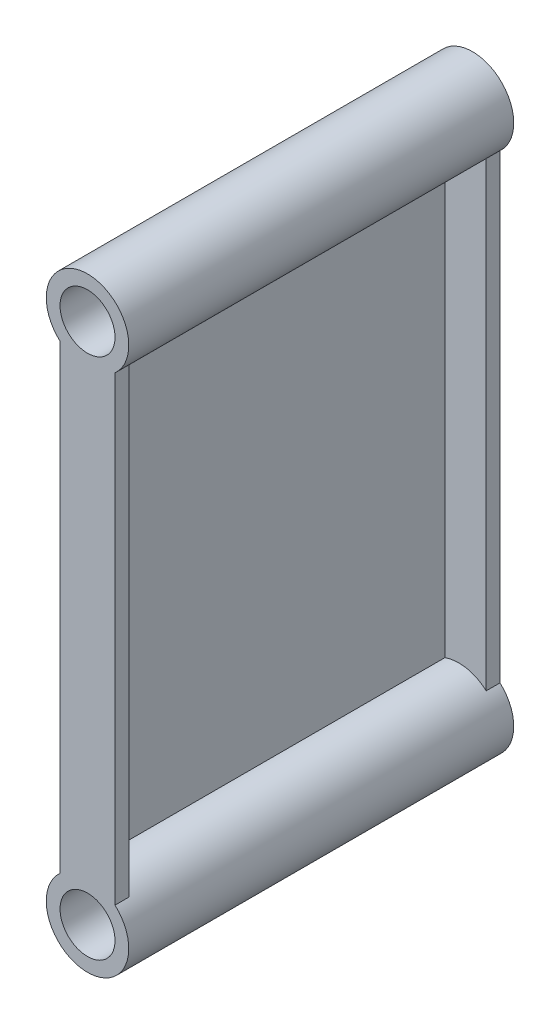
ISO-10303-21;
HEADER;
FILE_DESCRIPTION(('STEP AP214'),'2;1');
FILE_NAME('part.step','',(''),(''),'','','');
FILE_SCHEMA(('AUTOMOTIVE_DESIGN { 1 0 10303 214 1 1 1 1 }'));
ENDSEC;
DATA;
#1=APPLICATION_CONTEXT('core data for automotive mechanical design processes');
#2=APPLICATION_PROTOCOL_DEFINITION('international standard','automotive_design',2000,#1);
#3=PRODUCT_CONTEXT('',#1,'mechanical');
#4=PRODUCT('Part','Part','',(#3));
#5=PRODUCT_RELATED_PRODUCT_CATEGORY('part','',(#4));
#6=PRODUCT_DEFINITION_FORMATION('','',#4);
#7=PRODUCT_DEFINITION_CONTEXT('part definition',#1,'design');
#8=PRODUCT_DEFINITION('design','',#6,#7);
#9=PRODUCT_DEFINITION_SHAPE('','',#8);
#10=(LENGTH_UNIT() NAMED_UNIT(*) SI_UNIT(.MILLI.,.METRE.));
#11=(NAMED_UNIT(*) PLANE_ANGLE_UNIT() SI_UNIT($,.RADIAN.));
#12=(NAMED_UNIT(*) SI_UNIT($,.STERADIAN.) SOLID_ANGLE_UNIT());
#13=UNCERTAINTY_MEASURE_WITH_UNIT(LENGTH_MEASURE(1.E-05),#10,'distance_accuracy_value','');
#14=(GEOMETRIC_REPRESENTATION_CONTEXT(3) GLOBAL_UNCERTAINTY_ASSIGNED_CONTEXT((#13)) GLOBAL_UNIT_ASSIGNED_CONTEXT((#10,
#11,#12)) REPRESENTATION_CONTEXT('',''));
#15=CARTESIAN_POINT('',(0.,0.,0.));
#16=DIRECTION('',(0.,0.,1.));
#17=DIRECTION('',(1.,0.,0.));
#18=AXIS2_PLACEMENT_3D('',#15,#16,#17);
#19=CARTESIAN_POINT('',(0.999999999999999,8.3819660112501,14.));
#20=DIRECTION('',(-1.,0.,0.));
#21=DIRECTION('',(0.,-1.,0.));
#22=AXIS2_PLACEMENT_3D('',#19,#20,#21);
#23=PLANE('',#22);
#24=DIRECTION('',(0.,1.,0.));
#25=VECTOR('',#24,1.);
#26=CARTESIAN_POINT('',(0.999999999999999,8.3819660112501,0.5));
#27=LINE('',#26,#25);
#28=CARTESIAN_POINT('',(1.,-8.38196601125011,0.5));
#29=VERTEX_POINT('',#28);
#30=CARTESIAN_POINT('',(0.999999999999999,8.3819660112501,0.5));
#31=VERTEX_POINT('',#30);
#32=EDGE_CURVE('E160',#29,#31,#27,.T.);
#33=ORIENTED_EDGE('',*,*,#32,.F.);
#34=DIRECTION('',(0.,0.,-1.));
#35=VECTOR('',#34,1.);
#36=CARTESIAN_POINT('',(1.,-8.38196601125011,14.));
#37=LINE('',#36,#35);
#38=CARTESIAN_POINT('',(1.,-8.38196601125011,0.));
#39=VERTEX_POINT('',#38);
#40=EDGE_CURVE('E126',#29,#39,#37,.T.);
#41=ORIENTED_EDGE('',*,*,#40,.T.);
#42=DIRECTION('',(0.,1.,0.));
#43=VECTOR('',#42,1.);
#44=CARTESIAN_POINT('',(0.999999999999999,8.3819660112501,0.));
#45=LINE('',#44,#43);
#46=CARTESIAN_POINT('',(0.999999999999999,8.3819660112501,0.));
#47=VERTEX_POINT('',#46);
#48=EDGE_CURVE('E132',#39,#47,#45,.T.);
#49=ORIENTED_EDGE('',*,*,#48,.T.);
#50=DIRECTION('',(0.,0.,-1.));
#51=VECTOR('',#50,1.);
#52=CARTESIAN_POINT('',(0.999999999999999,8.3819660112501,14.));
#53=LINE('',#52,#51);
#54=EDGE_CURVE('E76',#31,#47,#53,.T.);
#55=ORIENTED_EDGE('',*,*,#54,.F.);
#56=EDGE_LOOP('',(#33,#41,#49,#55));
#57=FACE_BOUND('',#56,.T.);
#58=ADVANCED_FACE('F30',(#57),#23,.F.);
#59=CARTESIAN_POINT('',(0.,9.49999999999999,14.));
#60=DIRECTION('',(0.,0.,-1.));
#61=DIRECTION('',(-1.,0.,0.));
#62=AXIS2_PLACEMENT_3D('',#59,#60,#61);
#63=CYLINDRICAL_SURFACE('',#62,1.5);
#64=CARTESIAN_POINT('',(0.,9.49999999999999,0.));
#65=DIRECTION('',(0.,0.,1.));
#66=DIRECTION('',(1.,0.,0.));
#67=AXIS2_PLACEMENT_3D('',#64,#65,#66);
#68=CIRCLE('',#67,1.5);
#69=CARTESIAN_POINT('',(-1.,8.38196601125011,0.));
#70=VERTEX_POINT('',#69);
#71=EDGE_CURVE('E139',#47,#70,#68,.T.);
#72=ORIENTED_EDGE('',*,*,#71,.T.);
#73=DIRECTION('',(0.,0.,-1.));
#74=VECTOR('',#73,1.);
#75=CARTESIAN_POINT('',(-1.,8.38196601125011,14.));
#76=LINE('',#75,#74);
#77=CARTESIAN_POINT('',(-1.,8.38196601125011,14.));
#78=VERTEX_POINT('',#77);
#79=EDGE_CURVE('E11',#78,#70,#76,.T.);
#80=ORIENTED_EDGE('',*,*,#79,.F.);
#81=CARTESIAN_POINT('',(0.,9.49999999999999,14.));
#82=DIRECTION('',(0.,0.,1.));
#83=DIRECTION('',(1.,0.,0.));
#84=AXIS2_PLACEMENT_3D('',#81,#82,#83);
#85=CIRCLE('',#84,1.5);
#86=CARTESIAN_POINT('',(0.999999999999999,8.3819660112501,14.));
#87=VERTEX_POINT('',#86);
#88=EDGE_CURVE('E134',#87,#78,#85,.T.);
#89=ORIENTED_EDGE('',*,*,#88,.F.);
#90=CARTESIAN_POINT('',(0.999999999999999,8.3819660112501,13.5));
#91=VERTEX_POINT('',#90);
#92=EDGE_CURVE('E129',#87,#91,#53,.T.);
#93=ORIENTED_EDGE('',*,*,#92,.T.);
#94=CARTESIAN_POINT('',(0.,9.49999999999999,13.5));
#95=DIRECTION('',(0.,0.,1.));
#96=DIRECTION('',(1.,0.,0.));
#97=AXIS2_PLACEMENT_3D('',#94,#95,#96);
#98=CIRCLE('',#97,1.5);
#99=CARTESIAN_POINT('',(-0.500000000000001,8.0857864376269,13.5));
#100=VERTEX_POINT('',#99);
#101=EDGE_CURVE('E45',#100,#91,#98,.T.);
#102=ORIENTED_EDGE('',*,*,#101,.F.);
#103=DIRECTION('',(0.,0.,1.));
#104=VECTOR('',#103,1.);
#105=CARTESIAN_POINT('',(-0.500000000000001,8.0857864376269,0.));
#106=LINE('',#105,#104);
#107=CARTESIAN_POINT('',(-0.500000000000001,8.0857864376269,0.5));
#108=VERTEX_POINT('',#107);
#109=EDGE_CURVE('E122',#108,#100,#106,.T.);
#110=ORIENTED_EDGE('',*,*,#109,.F.);
#111=CARTESIAN_POINT('',(0.,9.49999999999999,0.5));
#112=DIRECTION('',(0.,0.,1.));
#113=DIRECTION('',(1.,0.,0.));
#114=AXIS2_PLACEMENT_3D('',#111,#112,#113);
#115=CIRCLE('',#114,1.5);
#116=EDGE_CURVE('E164',#108,#31,#115,.T.);
#117=ORIENTED_EDGE('',*,*,#116,.T.);
#118=ORIENTED_EDGE('',*,*,#54,.T.);
#119=EDGE_LOOP('',(#72,#80,#89,#93,#102,#110,#117,#118));
#120=FACE_BOUND('',#119,.T.);
#121=ADVANCED_FACE('F32',(#120),#63,.T.);
#122=CARTESIAN_POINT('',(-1.,8.38196601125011,14.));
#123=DIRECTION('',(1.,0.,0.));
#124=DIRECTION('',(0.,1.,0.));
#125=AXIS2_PLACEMENT_3D('',#122,#123,#124);
#126=PLANE('',#125);
#127=DIRECTION('',(0.,-1.,0.));
#128=VECTOR('',#127,1.);
#129=CARTESIAN_POINT('',(-1.,8.38196601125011,0.));
#130=LINE('',#129,#128);
#131=CARTESIAN_POINT('',(-0.999999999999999,-8.38196601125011,0.));
#132=VERTEX_POINT('',#131);
#133=EDGE_CURVE('E137',#70,#132,#130,.T.);
#134=ORIENTED_EDGE('',*,*,#133,.T.);
#135=DIRECTION('',(0.,0.,-1.));
#136=VECTOR('',#135,1.);
#137=CARTESIAN_POINT('',(-0.999999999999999,-8.38196601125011,14.));
#138=LINE('',#137,#136);
#139=CARTESIAN_POINT('',(-0.999999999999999,-8.38196601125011,14.));
#140=VERTEX_POINT('',#139);
#141=EDGE_CURVE('E38',#140,#132,#138,.T.);
#142=ORIENTED_EDGE('',*,*,#141,.F.);
#143=DIRECTION('',(0.,-1.,0.));
#144=VECTOR('',#143,1.);
#145=CARTESIAN_POINT('',(-1.,8.38196601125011,14.));
#146=LINE('',#145,#144);
#147=EDGE_CURVE('E83',#78,#140,#146,.T.);
#148=ORIENTED_EDGE('',*,*,#147,.F.);
#149=ORIENTED_EDGE('',*,*,#79,.T.);
#150=EDGE_LOOP('',(#134,#142,#148,#149));
#151=FACE_BOUND('',#150,.T.);
#152=ADVANCED_FACE('F184',(#151),#126,.F.);
#153=CARTESIAN_POINT('',(0.,-9.5,14.));
#154=DIRECTION('',(0.,0.,-1.));
#155=DIRECTION('',(-1.,0.,0.));
#156=AXIS2_PLACEMENT_3D('',#153,#154,#155);
#157=CYLINDRICAL_SURFACE('',#156,1.5);
#158=CARTESIAN_POINT('',(0.,-9.5,0.));
#159=DIRECTION('',(0.,0.,1.));
#160=DIRECTION('',(1.,0.,0.));
#161=AXIS2_PLACEMENT_3D('',#158,#159,#160);
#162=CIRCLE('',#161,1.5);
#163=EDGE_CURVE('E135',#132,#39,#162,.T.);
#164=ORIENTED_EDGE('',*,*,#163,.T.);
#165=ORIENTED_EDGE('',*,*,#40,.F.);
#166=CARTESIAN_POINT('',(0.,-9.5,0.5));
#167=DIRECTION('',(0.,0.,1.));
#168=DIRECTION('',(1.,0.,0.));
#169=AXIS2_PLACEMENT_3D('',#166,#167,#168);
#170=CIRCLE('',#169,1.5);
#171=CARTESIAN_POINT('',(-0.499999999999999,-8.08578643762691,0.5));
#172=VERTEX_POINT('',#171);
#173=EDGE_CURVE('E116',#29,#172,#170,.T.);
#174=ORIENTED_EDGE('',*,*,#173,.T.);
#175=DIRECTION('',(0.,0.,1.));
#176=VECTOR('',#175,1.);
#177=CARTESIAN_POINT('',(-0.499999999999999,-8.08578643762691,0.));
#178=LINE('',#177,#176);
#179=CARTESIAN_POINT('',(-0.499999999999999,-8.08578643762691,13.5));
#180=VERTEX_POINT('',#179);
#181=EDGE_CURVE('E114',#172,#180,#178,.T.);
#182=ORIENTED_EDGE('',*,*,#181,.T.);
#183=CARTESIAN_POINT('',(0.,-9.5,13.5));
#184=DIRECTION('',(0.,0.,1.));
#185=DIRECTION('',(1.,0.,0.));
#186=AXIS2_PLACEMENT_3D('',#183,#184,#185);
#187=CIRCLE('',#186,1.5);
#188=CARTESIAN_POINT('',(1.,-8.38196601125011,13.5));
#189=VERTEX_POINT('',#188);
#190=EDGE_CURVE('E107',#189,#180,#187,.T.);
#191=ORIENTED_EDGE('',*,*,#190,.F.);
#192=CARTESIAN_POINT('',(1.,-8.38196601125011,14.));
#193=VERTEX_POINT('',#192);
#194=EDGE_CURVE('E112',#193,#189,#37,.T.);
#195=ORIENTED_EDGE('',*,*,#194,.F.);
#196=CARTESIAN_POINT('',(0.,-9.5,14.));
#197=DIRECTION('',(0.,0.,1.));
#198=DIRECTION('',(1.,0.,0.));
#199=AXIS2_PLACEMENT_3D('',#196,#197,#198);
#200=CIRCLE('',#199,1.5);
#201=EDGE_CURVE('E143',#140,#193,#200,.T.);
#202=ORIENTED_EDGE('',*,*,#201,.F.);
#203=ORIENTED_EDGE('',*,*,#141,.T.);
#204=EDGE_LOOP('',(#164,#165,#174,#182,#191,#195,#202,#203));
#205=FACE_BOUND('',#204,.T.);
#206=ADVANCED_FACE('F109',(#205),#157,.T.);
#207=ORIENTED_EDGE('',*,*,#194,.T.);
#208=DIRECTION('',(0.,1.,0.));
#209=VECTOR('',#208,1.);
#210=CARTESIAN_POINT('',(0.999999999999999,8.3819660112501,13.5));
#211=LINE('',#210,#209);
#212=EDGE_CURVE('E118',#189,#91,#211,.T.);
#213=ORIENTED_EDGE('',*,*,#212,.T.);
#214=ORIENTED_EDGE('',*,*,#92,.F.);
#215=DIRECTION('',(0.,1.,0.));
#216=VECTOR('',#215,1.);
#217=CARTESIAN_POINT('',(0.999999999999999,8.3819660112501,14.));
#218=LINE('',#217,#216);
#219=EDGE_CURVE('E54',#193,#87,#218,.T.);
#220=ORIENTED_EDGE('',*,*,#219,.F.);
#221=EDGE_LOOP('',(#207,#213,#214,#220));
#222=FACE_BOUND('',#221,.T.);
#223=ADVANCED_FACE('F125',(#222),#23,.F.);
#224=CARTESIAN_POINT('',(0.,9.49999999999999,14.));
#225=DIRECTION('',(0.,0.,1.));
#226=DIRECTION('',(1.,0.,0.));
#227=AXIS2_PLACEMENT_3D('',#224,#225,#226);
#228=PLANE('',#227);
#229=CARTESIAN_POINT('',(0.,-9.5,14.));
#230=DIRECTION('',(0.,0.,1.));
#231=DIRECTION('',(1.,0.,0.));
#232=AXIS2_PLACEMENT_3D('',#229,#230,#231);
#233=CIRCLE('',#232,1.);
#234=CARTESIAN_POINT('',(1.,-9.5,14.));
#235=VERTEX_POINT('',#234);
#236=EDGE_CURVE('E153',#235,#235,#233,.T.);
#237=ORIENTED_EDGE('',*,*,#236,.F.);
#238=EDGE_LOOP('',(#237));
#239=FACE_BOUND('',#238,.T.);
#240=CARTESIAN_POINT('',(0.,9.49999999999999,14.));
#241=DIRECTION('',(0.,0.,1.));
#242=DIRECTION('',(1.,0.,0.));
#243=AXIS2_PLACEMENT_3D('',#240,#241,#242);
#244=CIRCLE('',#243,1.);
#245=CARTESIAN_POINT('',(1.,9.49999999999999,14.));
#246=VERTEX_POINT('',#245);
#247=EDGE_CURVE('E147',#246,#246,#244,.T.);
#248=ORIENTED_EDGE('',*,*,#247,.F.);
#249=EDGE_LOOP('',(#248));
#250=FACE_BOUND('',#249,.T.);
#251=ORIENTED_EDGE('',*,*,#88,.T.);
#252=ORIENTED_EDGE('',*,*,#147,.T.);
#253=ORIENTED_EDGE('',*,*,#201,.T.);
#254=ORIENTED_EDGE('',*,*,#219,.T.);
#255=EDGE_LOOP('',(#251,#252,#253,#254));
#256=FACE_BOUND('',#255,.T.);
#257=ADVANCED_FACE('F183',(#239,#250,#256),#228,.T.);
#258=CARTESIAN_POINT('',(0.,9.49999999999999,0.));
#259=DIRECTION('',(0.,0.,1.));
#260=DIRECTION('',(1.,0.,0.));
#261=AXIS2_PLACEMENT_3D('',#258,#259,#260);
#262=PLANE('',#261);
#263=CARTESIAN_POINT('',(0.,-9.5,0.));
#264=DIRECTION('',(0.,0.,1.));
#265=DIRECTION('',(1.,0.,0.));
#266=AXIS2_PLACEMENT_3D('',#263,#264,#265);
#267=CIRCLE('',#266,1.);
#268=CARTESIAN_POINT('',(1.,-9.5,0.));
#269=VERTEX_POINT('',#268);
#270=EDGE_CURVE('E150',#269,#269,#267,.T.);
#271=ORIENTED_EDGE('',*,*,#270,.T.);
#272=EDGE_LOOP('',(#271));
#273=FACE_BOUND('',#272,.T.);
#274=CARTESIAN_POINT('',(0.,9.49999999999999,0.));
#275=DIRECTION('',(0.,0.,1.));
#276=DIRECTION('',(1.,0.,0.));
#277=AXIS2_PLACEMENT_3D('',#274,#275,#276);
#278=CIRCLE('',#277,1.);
#279=CARTESIAN_POINT('',(1.,9.49999999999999,0.));
#280=VERTEX_POINT('',#279);
#281=EDGE_CURVE('E141',#280,#280,#278,.T.);
#282=ORIENTED_EDGE('',*,*,#281,.T.);
#283=EDGE_LOOP('',(#282));
#284=FACE_BOUND('',#283,.T.);
#285=ORIENTED_EDGE('',*,*,#71,.F.);
#286=ORIENTED_EDGE('',*,*,#48,.F.);
#287=ORIENTED_EDGE('',*,*,#163,.F.);
#288=ORIENTED_EDGE('',*,*,#133,.F.);
#289=EDGE_LOOP('',(#285,#286,#287,#288));
#290=FACE_BOUND('',#289,.T.);
#291=ADVANCED_FACE('F186',(#273,#284,#290),#262,.F.);
#292=CARTESIAN_POINT('',(0.,9.49999999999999,0.));
#293=DIRECTION('',(0.,0.,1.));
#294=DIRECTION('',(1.,0.,0.));
#295=AXIS2_PLACEMENT_3D('',#292,#293,#294);
#296=CYLINDRICAL_SURFACE('',#295,1.);
#297=ORIENTED_EDGE('',*,*,#281,.F.);
#298=EDGE_LOOP('',(#297));
#299=FACE_BOUND('',#298,.T.);
#300=ORIENTED_EDGE('',*,*,#247,.T.);
#301=EDGE_LOOP('',(#300));
#302=FACE_BOUND('',#301,.T.);
#303=ADVANCED_FACE('F188',(#299,#302),#296,.F.);
#304=CARTESIAN_POINT('',(0.,-9.5,0.));
#305=DIRECTION('',(0.,0.,1.));
#306=DIRECTION('',(1.,0.,0.));
#307=AXIS2_PLACEMENT_3D('',#304,#305,#306);
#308=CYLINDRICAL_SURFACE('',#307,1.);
#309=ORIENTED_EDGE('',*,*,#270,.F.);
#310=EDGE_LOOP('',(#309));
#311=FACE_BOUND('',#310,.T.);
#312=ORIENTED_EDGE('',*,*,#236,.T.);
#313=EDGE_LOOP('',(#312));
#314=FACE_BOUND('',#313,.T.);
#315=ADVANCED_FACE('F195',(#311,#314),#308,.F.);
#316=CARTESIAN_POINT('',(-0.500000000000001,8.38196601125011,14.));
#317=DIRECTION('',(1.,0.,0.));
#318=DIRECTION('',(0.,1.,0.));
#319=AXIS2_PLACEMENT_3D('',#316,#317,#318);
#320=PLANE('',#319);
#321=DIRECTION('',(0.,-1.,0.));
#322=VECTOR('',#321,1.);
#323=CARTESIAN_POINT('',(-0.500000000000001,8.38196601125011,0.5));
#324=LINE('',#323,#322);
#325=EDGE_CURVE('E161',#108,#172,#324,.T.);
#326=ORIENTED_EDGE('',*,*,#325,.F.);
#327=ORIENTED_EDGE('',*,*,#109,.T.);
#328=DIRECTION('',(0.,-1.,0.));
#329=VECTOR('',#328,1.);
#330=CARTESIAN_POINT('',(-0.500000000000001,8.38196601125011,13.5));
#331=LINE('',#330,#329);
#332=EDGE_CURVE('E123',#100,#180,#331,.T.);
#333=ORIENTED_EDGE('',*,*,#332,.T.);
#334=ORIENTED_EDGE('',*,*,#181,.F.);
#335=EDGE_LOOP('',(#326,#327,#333,#334));
#336=FACE_BOUND('',#335,.T.);
#337=ADVANCED_FACE('F175',(#336),#320,.T.);
#338=CARTESIAN_POINT('',(0.,9.49999999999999,13.5));
#339=DIRECTION('',(0.,0.,1.));
#340=DIRECTION('',(1.,0.,0.));
#341=AXIS2_PLACEMENT_3D('',#338,#339,#340);
#342=PLANE('',#341);
#343=ORIENTED_EDGE('',*,*,#101,.T.);
#344=ORIENTED_EDGE('',*,*,#212,.F.);
#345=ORIENTED_EDGE('',*,*,#190,.T.);
#346=ORIENTED_EDGE('',*,*,#332,.F.);
#347=EDGE_LOOP('',(#343,#344,#345,#346));
#348=FACE_BOUND('',#347,.T.);
#349=ADVANCED_FACE('F119',(#348),#342,.F.);
#350=CARTESIAN_POINT('',(0.,9.49999999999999,0.5));
#351=DIRECTION('',(0.,0.,1.));
#352=DIRECTION('',(1.,0.,0.));
#353=AXIS2_PLACEMENT_3D('',#350,#351,#352);
#354=PLANE('',#353);
#355=ORIENTED_EDGE('',*,*,#116,.F.);
#356=ORIENTED_EDGE('',*,*,#325,.T.);
#357=ORIENTED_EDGE('',*,*,#173,.F.);
#358=ORIENTED_EDGE('',*,*,#32,.T.);
#359=EDGE_LOOP('',(#355,#356,#357,#358));
#360=FACE_BOUND('',#359,.T.);
#361=ADVANCED_FACE('F172',(#360),#354,.T.);
#362=CLOSED_SHELL('',(#58,#121,#152,#206,#223,#257,#291,#303,#315,#337,#349,#361));
#363=MANIFOLD_SOLID_BREP('B2',#362);
#364=ADVANCED_BREP_SHAPE_REPRESENTATION('',(#18,#363),#14);
#365=SHAPE_DEFINITION_REPRESENTATION(#9,#364);
ENDSEC;
END-ISO-10303-21;
